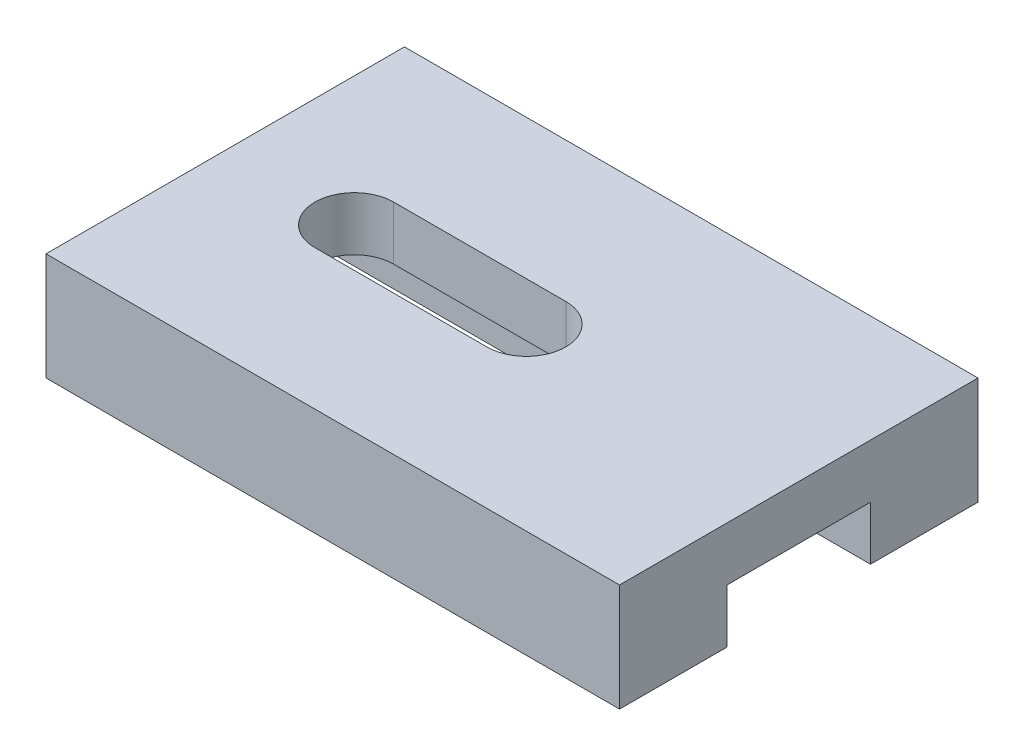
from build123d import *

# Parameters (mm, degrees)
SKETCH1_W           = 160
SKETCH1_H           = 100
EXTRUDE1_DEPTH      = 30
SKETCH_1_W          = 40
SKETCH_1_H          = 15
CUT_EXTRUDE_1_DEPTH = 171.293863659
CUT_EXTRUDE_2_DEPTH = 116.758369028


with BuildPart() as part:
    # Sketch1 → Extrude1 (new body)
    with BuildSketch(Plane(origin=(0, 0, 0), x_dir=(1, 0, 0), z_dir=(0, 1, 0))):
        with Locations((20, 0)):
            Rectangle(SKETCH1_W, SKETCH1_H)
    extrude(amount=EXTRUDE1_DEPTH)

    # Sketch 1 → Cut-Extrude 1 (cut, through all)
    with BuildSketch(Plane.ZY.offset(60)):
        with Locations((0, 7.5)):
            Rectangle(SKETCH_1_W, SKETCH_1_H)
    extrude(amount=-CUT_EXTRUDE_1_DEPTH, mode=Mode.SUBTRACT)

    # Sketch 2 → Cut-Extrude 2 (cut, through all)
    with BuildSketch(Plane(origin=(0, 30, 0), x_dir=(1, 0, 0), z_dir=(0, 1, 0))):
        with BuildLine():
            Line((24, 11), (-24, 11))
            ThreePointArc((-24, 11), (-35, 0), (-24, -11))
            Line((-24, -11), (24, -11))
            ThreePointArc((24, -11), (35, 0), (24, 11))
        make_face()
    extrude(amount=-CUT_EXTRUDE_2_DEPTH, mode=Mode.SUBTRACT)


solid = part.part
